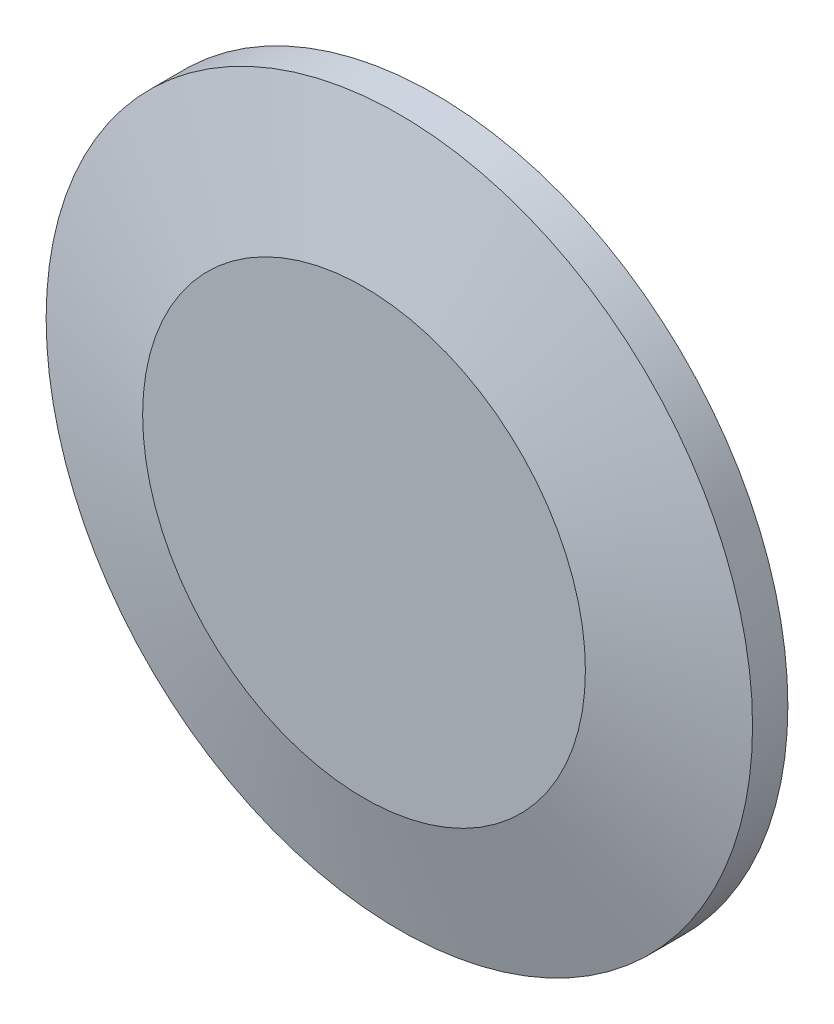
ISO-10303-21;
HEADER;
FILE_DESCRIPTION(('STEP AP214'),'2;1');
FILE_NAME('part.step','',(''),(''),'','','');
FILE_SCHEMA(('AUTOMOTIVE_DESIGN { 1 0 10303 214 1 1 1 1 }'));
ENDSEC;
DATA;
#1=APPLICATION_CONTEXT('core data for automotive mechanical design processes');
#2=APPLICATION_PROTOCOL_DEFINITION('international standard','automotive_design',2000,#1);
#3=PRODUCT_CONTEXT('',#1,'mechanical');
#4=PRODUCT('Part','Part','',(#3));
#5=PRODUCT_RELATED_PRODUCT_CATEGORY('part','',(#4));
#6=PRODUCT_DEFINITION_FORMATION('','',#4);
#7=PRODUCT_DEFINITION_CONTEXT('part definition',#1,'design');
#8=PRODUCT_DEFINITION('design','',#6,#7);
#9=PRODUCT_DEFINITION_SHAPE('','',#8);
#10=(LENGTH_UNIT() NAMED_UNIT(*) SI_UNIT(.MILLI.,.METRE.));
#11=(NAMED_UNIT(*) PLANE_ANGLE_UNIT() SI_UNIT($,.RADIAN.));
#12=(NAMED_UNIT(*) SI_UNIT($,.STERADIAN.) SOLID_ANGLE_UNIT());
#13=UNCERTAINTY_MEASURE_WITH_UNIT(LENGTH_MEASURE(1.E-05),#10,'distance_accuracy_value','');
#14=(GEOMETRIC_REPRESENTATION_CONTEXT(3) GLOBAL_UNCERTAINTY_ASSIGNED_CONTEXT((#13)) GLOBAL_UNIT_ASSIGNED_CONTEXT((#10,
#11,#12)) REPRESENTATION_CONTEXT('',''));
#15=CARTESIAN_POINT('',(0.,0.,0.));
#16=DIRECTION('',(0.,0.,1.));
#17=DIRECTION('',(1.,0.,0.));
#18=AXIS2_PLACEMENT_3D('',#15,#16,#17);
#19=CARTESIAN_POINT('',(0.,0.,2.54));
#20=DIRECTION('',(0.,0.,-1.));
#21=DIRECTION('',(-1.,0.,0.));
#22=AXIS2_PLACEMENT_3D('',#19,#20,#21);
#23=CYLINDRICAL_SURFACE('',#22,25.4);
#24=CARTESIAN_POINT('',(0.,0.,2.54));
#25=DIRECTION('',(0.,0.,1.));
#26=DIRECTION('',(1.,0.,0.));
#27=AXIS2_PLACEMENT_3D('',#24,#25,#26);
#28=CIRCLE('',#27,25.4);
#29=CARTESIAN_POINT('',(25.4,0.,2.54));
#30=VERTEX_POINT('',#29);
#31=EDGE_CURVE('E10',#30,#30,#28,.T.);
#32=ORIENTED_EDGE('',*,*,#31,.F.);
#33=EDGE_LOOP('',(#32));
#34=FACE_BOUND('',#33,.T.);
#35=CARTESIAN_POINT('',(0.,0.,0.));
#36=DIRECTION('',(0.,0.,1.));
#37=DIRECTION('',(1.,0.,0.));
#38=AXIS2_PLACEMENT_3D('',#35,#36,#37);
#39=CIRCLE('',#38,25.4);
#40=CARTESIAN_POINT('',(25.4,0.,0.));
#41=VERTEX_POINT('',#40);
#42=EDGE_CURVE('E36',#41,#41,#39,.T.);
#43=ORIENTED_EDGE('',*,*,#42,.T.);
#44=EDGE_LOOP('',(#43));
#45=FACE_BOUND('',#44,.T.);
#46=ADVANCED_FACE('F33',(#34,#45),#23,.T.);
#47=CARTESIAN_POINT('',(0.,0.,0.));
#48=DIRECTION('',(0.,0.,1.));
#49=DIRECTION('',(1.,0.,0.));
#50=AXIS2_PLACEMENT_3D('',#47,#48,#49);
#51=PLANE('',#50);
#52=CARTESIAN_POINT('',(0.,0.,0.));
#53=DIRECTION('',(0.,0.,-1.));
#54=DIRECTION('',(-1.,0.,0.));
#55=AXIS2_PLACEMENT_3D('',#52,#53,#54);
#56=CIRCLE('',#55,2.54);
#57=CARTESIAN_POINT('',(-2.54,0.,0.));
#58=VERTEX_POINT('',#57);
#59=EDGE_CURVE('E48',#58,#58,#56,.T.);
#60=ORIENTED_EDGE('',*,*,#59,.F.);
#61=EDGE_LOOP('',(#60));
#62=FACE_BOUND('',#61,.T.);
#63=ORIENTED_EDGE('',*,*,#42,.F.);
#64=EDGE_LOOP('',(#63));
#65=FACE_BOUND('',#64,.T.);
#66=ADVANCED_FACE('F63',(#62,#65),#51,.F.);
#67=CARTESIAN_POINT('',(0.,0.,2.54));
#68=DIRECTION('',(0.,0.,-1.));
#69=DIRECTION('',(1.,0.,0.));
#70=AXIS2_PLACEMENT_3D('',#67,#68,#69);
#71=CONICAL_SURFACE('',#70,25.4,1.30899693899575);
#72=CARTESIAN_POINT('',(0.,0.,5.08));
#73=DIRECTION('',(0.,0.,1.));
#74=DIRECTION('',(1.,0.,0.));
#75=AXIS2_PLACEMENT_3D('',#72,#73,#74);
#76=CIRCLE('',#75,15.920590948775);
#77=CARTESIAN_POINT('',(15.920590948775,0.,5.08));
#78=VERTEX_POINT('',#77);
#79=EDGE_CURVE('E43',#78,#78,#76,.T.);
#80=ORIENTED_EDGE('',*,*,#79,.F.);
#81=EDGE_LOOP('',(#80));
#82=FACE_BOUND('',#81,.T.);
#83=ORIENTED_EDGE('',*,*,#31,.T.);
#84=EDGE_LOOP('',(#83));
#85=FACE_BOUND('',#84,.T.);
#86=ADVANCED_FACE('F66',(#82,#85),#71,.T.);
#87=CARTESIAN_POINT('',(0.,0.,5.08));
#88=DIRECTION('',(0.,0.,1.));
#89=DIRECTION('',(1.,0.,0.));
#90=AXIS2_PLACEMENT_3D('',#87,#88,#89);
#91=PLANE('',#90);
#92=ORIENTED_EDGE('',*,*,#79,.T.);
#93=EDGE_LOOP('',(#92));
#94=FACE_BOUND('',#93,.T.);
#95=ADVANCED_FACE('F59',(#94),#91,.T.);
#96=CARTESIAN_POINT('',(0.,0.,2.54));
#97=DIRECTION('',(0.,0.,-1.));
#98=DIRECTION('',(-1.,0.,0.));
#99=AXIS2_PLACEMENT_3D('',#96,#97,#98);
#100=CYLINDRICAL_SURFACE('',#99,2.54);
#101=CARTESIAN_POINT('',(0.,0.,2.54));
#102=DIRECTION('',(0.,0.,-1.));
#103=DIRECTION('',(-1.,0.,0.));
#104=AXIS2_PLACEMENT_3D('',#101,#102,#103);
#105=CIRCLE('',#104,2.54);
#106=CARTESIAN_POINT('',(-2.54,0.,2.54));
#107=VERTEX_POINT('',#106);
#108=EDGE_CURVE('E47',#107,#107,#105,.T.);
#109=ORIENTED_EDGE('',*,*,#108,.F.);
#110=EDGE_LOOP('',(#109));
#111=FACE_BOUND('',#110,.T.);
#112=ORIENTED_EDGE('',*,*,#59,.T.);
#113=EDGE_LOOP('',(#112));
#114=FACE_BOUND('',#113,.T.);
#115=ADVANCED_FACE('F56',(#111,#114),#100,.F.);
#116=CARTESIAN_POINT('',(0.,0.,2.54));
#117=DIRECTION('',(0.,0.,-1.));
#118=DIRECTION('',(-1.,0.,0.));
#119=AXIS2_PLACEMENT_3D('',#116,#117,#118);
#120=PLANE('',#119);
#121=ORIENTED_EDGE('',*,*,#108,.T.);
#122=EDGE_LOOP('',(#121));
#123=FACE_BOUND('',#122,.T.);
#124=ADVANCED_FACE('F54',(#123),#120,.T.);
#125=CLOSED_SHELL('',(#46,#66,#86,#95,#115,#124));
#126=MANIFOLD_SOLID_BREP('B2',#125);
#127=ADVANCED_BREP_SHAPE_REPRESENTATION('',(#18,#126),#14);
#128=SHAPE_DEFINITION_REPRESENTATION(#9,#127);
ENDSEC;
END-ISO-10303-21;
